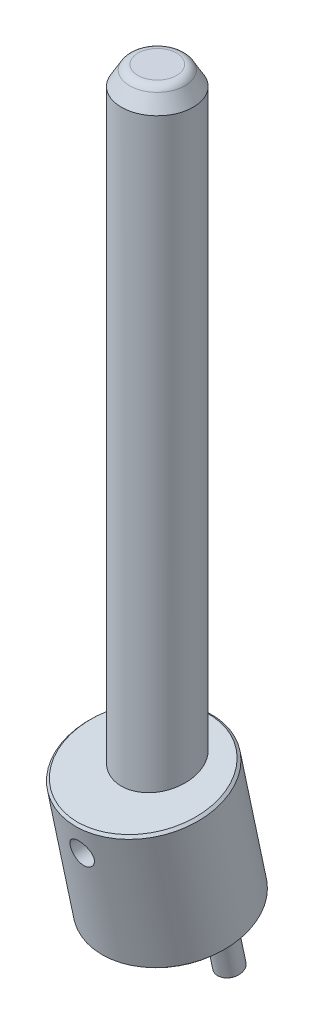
ISO-10303-21;
HEADER;
FILE_DESCRIPTION(('STEP AP214'),'2;1');
FILE_NAME('part.step','',(''),(''),'','','');
FILE_SCHEMA(('AUTOMOTIVE_DESIGN { 1 0 10303 214 1 1 1 1 }'));
ENDSEC;
DATA;
#1=APPLICATION_CONTEXT('core data for automotive mechanical design processes');
#2=APPLICATION_PROTOCOL_DEFINITION('international standard','automotive_design',2000,#1);
#3=PRODUCT_CONTEXT('',#1,'mechanical');
#4=PRODUCT('Part','Part','',(#3));
#5=PRODUCT_RELATED_PRODUCT_CATEGORY('part','',(#4));
#6=PRODUCT_DEFINITION_FORMATION('','',#4);
#7=PRODUCT_DEFINITION_CONTEXT('part definition',#1,'design');
#8=PRODUCT_DEFINITION('design','',#6,#7);
#9=PRODUCT_DEFINITION_SHAPE('','',#8);
#10=(LENGTH_UNIT() NAMED_UNIT(*) SI_UNIT(.MILLI.,.METRE.));
#11=(NAMED_UNIT(*) PLANE_ANGLE_UNIT() SI_UNIT($,.RADIAN.));
#12=(NAMED_UNIT(*) SI_UNIT($,.STERADIAN.) SOLID_ANGLE_UNIT());
#13=UNCERTAINTY_MEASURE_WITH_UNIT(LENGTH_MEASURE(1.E-05),#10,'distance_accuracy_value','');
#14=(GEOMETRIC_REPRESENTATION_CONTEXT(3) GLOBAL_UNCERTAINTY_ASSIGNED_CONTEXT((#13)) GLOBAL_UNIT_ASSIGNED_CONTEXT((#10,
#11,#12)) REPRESENTATION_CONTEXT('',''));
#15=CARTESIAN_POINT('',(0.,0.,0.));
#16=DIRECTION('',(0.,0.,1.));
#17=DIRECTION('',(1.,0.,0.));
#18=AXIS2_PLACEMENT_3D('',#15,#16,#17);
#19=CARTESIAN_POINT('',(0.,-24.717802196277,-8.68493275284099));
#20=DIRECTION('',(0.,-0.978147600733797,-0.207911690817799));
#21=DIRECTION('',(0.,0.207911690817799,-0.978147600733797));
#22=AXIS2_PLACEMENT_3D('',#19,#20,#21);
#23=PLANE('',#22);
#24=CARTESIAN_POINT('',(-21.5,-24.717802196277,-8.68493275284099));
#25=DIRECTION('',(0.,-0.978147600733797,-0.207911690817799));
#26=DIRECTION('',(0.,0.207911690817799,-0.978147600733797));
#27=AXIS2_PLACEMENT_3D('',#24,#25,#26);
#28=CIRCLE('',#27,4.50000075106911);
#29=CARTESIAN_POINT('',(-21.5,-23.7821994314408,-13.0865976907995));
#30=VERTEX_POINT('',#29);
#31=EDGE_CURVE('P0_E17',#30,#30,#28,.F.);
#32=ORIENTED_EDGE('',*,*,#31,.F.);
#33=EDGE_LOOP('',(#32));
#34=FACE_BOUND('',#33,.T.);
#35=ADVANCED_FACE('P0_F14',(#34),#23,.T.);
#36=CARTESIAN_POINT('',(0.,-24.717802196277,-8.68493275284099));
#37=DIRECTION('',(0.,-0.978147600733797,-0.207911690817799));
#38=DIRECTION('',(0.,0.207911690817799,-0.978147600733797));
#39=AXIS2_PLACEMENT_3D('',#36,#37,#38);
#40=PLANE('',#39);
#41=CARTESIAN_POINT('',(21.5,-24.717802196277,-8.68493275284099));
#42=DIRECTION('',(0.,-0.978147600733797,-0.207911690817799));
#43=DIRECTION('',(0.,0.207911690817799,-0.978147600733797));
#44=AXIS2_PLACEMENT_3D('',#41,#42,#43);
#45=CIRCLE('',#44,4.50000075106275);
#46=CARTESIAN_POINT('',(21.5,-23.7821994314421,-13.0865976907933));
#47=VERTEX_POINT('',#46);
#48=EDGE_CURVE('P0_E121',#47,#47,#45,.F.);
#49=ORIENTED_EDGE('',*,*,#48,.F.);
#50=EDGE_LOOP('',(#49));
#51=FACE_BOUND('',#50,.T.);
#52=ADVANCED_FACE('P0_F111',(#51),#40,.T.);
#53=CARTESIAN_POINT('',(0.,-3.09821612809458E-12,4.35415592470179E-13));
#54=DIRECTION('',(0.,-1.,0.));
#55=DIRECTION('',(0.,0.,-1.));
#56=AXIS2_PLACEMENT_3D('',#53,#54,#55);
#57=PLANE('',#56);
#58=CARTESIAN_POINT('',(0.,-3.69669572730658E-12,3.46077333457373E-12));
#59=DIRECTION('',(0.,-1.,0.));
#60=DIRECTION('',(0.,0.,-1.));
#61=AXIS2_PLACEMENT_3D('',#58,#59,#60);
#62=CIRCLE('',#61,15.);
#63=CARTESIAN_POINT('',(0.,-3.69669572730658E-12,-14.9999999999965));
#64=VERTEX_POINT('',#63);
#65=EDGE_CURVE('P0_E36',#64,#64,#62,.F.);
#66=ORIENTED_EDGE('',*,*,#65,.T.);
#67=EDGE_LOOP('',(#66));
#68=FACE_BOUND('',#67,.T.);
#69=ADVANCED_FACE('P0_F108',(#68),#57,.F.);
#70=CARTESIAN_POINT('',(-21.5,-24.2287278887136,-8.58097679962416));
#71=DIRECTION('',(0.,0.978147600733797,0.207911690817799));
#72=DIRECTION('',(0.,-0.207911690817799,0.978147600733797));
#73=AXIS2_PLACEMENT_3D('',#70,#71,#72);
#74=CONICAL_SURFACE('',#73,5.00000135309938,0.785398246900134);
#75=CARTESIAN_POINT('',(-21.5,-24.228726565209,-8.58097651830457));
#76=DIRECTION('',(0.,-0.978147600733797,-0.207911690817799));
#77=DIRECTION('',(0.,0.207911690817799,-0.978147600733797));
#78=AXIS2_PLACEMENT_3D('',#75,#76,#77);
#79=CIRCLE('',#78,5.);
#80=CARTESIAN_POINT('',(-21.5,-23.18916811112,-13.4717145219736));
#81=VERTEX_POINT('',#80);
#82=EDGE_CURVE('P0_E33',#81,#81,#79,.F.);
#83=ORIENTED_EDGE('',*,*,#82,.F.);
#84=EDGE_LOOP('',(#83));
#85=FACE_BOUND('',#84,.T.);
#86=ORIENTED_EDGE('',*,*,#31,.T.);
#87=EDGE_LOOP('',(#86));
#88=FACE_BOUND('',#87,.T.);
#89=ADVANCED_FACE('P0_F104',(#85,#88),#74,.T.);
#90=CARTESIAN_POINT('',(21.5,-24.2287278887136,-8.58097679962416));
#91=DIRECTION('',(0.,0.978147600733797,0.207911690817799));
#92=DIRECTION('',(0.,-0.207911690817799,0.978147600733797));
#93=AXIS2_PLACEMENT_3D('',#90,#91,#92);
#94=CONICAL_SURFACE('',#93,5.00000135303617,0.785398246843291);
#95=CARTESIAN_POINT('',(21.5,-24.228726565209,-8.58097651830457));
#96=DIRECTION('',(0.,-0.978147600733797,-0.207911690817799));
#97=DIRECTION('',(0.,0.207911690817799,-0.978147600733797));
#98=AXIS2_PLACEMENT_3D('',#95,#96,#97);
#99=CIRCLE('',#98,5.);
#100=CARTESIAN_POINT('',(21.5,-23.18916811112,-13.4717145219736));
#101=VERTEX_POINT('',#100);
#102=EDGE_CURVE('P0_E29',#101,#101,#99,.F.);
#103=ORIENTED_EDGE('',*,*,#102,.F.);
#104=EDGE_LOOP('',(#103));
#105=FACE_BOUND('',#104,.T.);
#106=ORIENTED_EDGE('',*,*,#48,.T.);
#107=EDGE_LOOP('',(#106));
#108=FACE_BOUND('',#107,.T.);
#109=ADVANCED_FACE('P0_F99',(#105,#108),#94,.T.);
#110=CARTESIAN_POINT('',(0.,61.1055773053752,3.46077333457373E-12));
#111=DIRECTION('',(0.,-1.,0.));
#112=DIRECTION('',(0.,0.,-1.));
#113=AXIS2_PLACEMENT_3D('',#110,#111,#112);
#114=CYLINDRICAL_SURFACE('',#113,15.);
#115=CARTESIAN_POINT('',(0.,44.9999999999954,3.45903861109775E-12));
#116=DIRECTION('',(0.,0.978147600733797,0.207911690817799));
#117=DIRECTION('',(0.,-0.207911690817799,0.978147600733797));
#118=AXIS2_PLACEMENT_3D('',#115,#116,#117);
#119=ELLIPSE('',#118,15.3351089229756,15.);
#120=CARTESIAN_POINT('',(0.,41.8116515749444,15.0000000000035));
#121=VERTEX_POINT('',#120);
#122=EDGE_CURVE('P0_E32',#121,#121,#119,.F.);
#123=ORIENTED_EDGE('',*,*,#122,.F.);
#124=EDGE_LOOP('',(#123));
#125=FACE_BOUND('',#124,.T.);
#126=ORIENTED_EDGE('',*,*,#65,.F.);
#127=EDGE_LOOP('',(#126));
#128=FACE_BOUND('',#127,.T.);
#129=CARTESIAN_POINT('',(0.,30.9999999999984,15.0000000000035));
#130=CARTESIAN_POINT('',(-0.13627460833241,30.9999999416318,14.9999999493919));
#131=CARTESIAN_POINT('',(-0.272550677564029,30.9944241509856,14.9981386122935));
#132=CARTESIAN_POINT('',(-0.544142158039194,30.9721706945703,14.9907428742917));
#133=CARTESIAN_POINT('',(-0.679457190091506,30.9554888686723,14.985207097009));
#134=CARTESIAN_POINT('',(-0.948257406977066,30.911149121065,14.970602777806));
#135=CARTESIAN_POINT('',(-1.08174007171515,30.8834773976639,14.9615297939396));
#136=CARTESIAN_POINT('',(-1.34580155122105,30.8174009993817,14.9400929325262));
#137=CARTESIAN_POINT('',(-1.47637921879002,30.7789921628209,14.9277277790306));
#138=CARTESIAN_POINT('',(-1.7333461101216,30.6918928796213,14.9000723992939));
#139=CARTESIAN_POINT('',(-1.85974572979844,30.6432305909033,14.8847901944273));
#140=CARTESIAN_POINT('',(-2.10792399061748,30.5359631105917,14.8516789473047));
#141=CARTESIAN_POINT('',(-2.22970089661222,30.4773542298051,14.833848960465));
#142=CARTESIAN_POINT('',(-2.58680471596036,30.2873070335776,14.7772227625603));
#143=CARTESIAN_POINT('',(-2.81420620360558,30.141545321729,14.7352562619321));
#144=CARTESIAN_POINT('',(-3.24874257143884,29.8108587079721,14.6457020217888));
#145=CARTESIAN_POINT('',(-3.45501840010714,29.6248491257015,14.5979792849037));
#146=CARTESIAN_POINT('',(-3.8341436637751,29.2211801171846,14.5030192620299));
#147=CARTESIAN_POINT('',(-4.0069839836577,29.003512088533,14.4557821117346));
#148=CARTESIAN_POINT('',(-4.31912807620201,28.5350726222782,14.3656662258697));
#149=CARTESIAN_POINT('',(-4.45732572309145,28.2835298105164,14.3229516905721));
#150=CARTESIAN_POINT('',(-4.68909399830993,27.7591186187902,14.2487652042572));
#151=CARTESIAN_POINT('',(-4.78267844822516,27.4862568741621,14.2172897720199));
#152=CARTESIAN_POINT('',(-4.91936749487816,26.9366338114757,14.1705651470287));
#153=CARTESIAN_POINT('',(-4.96406724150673,26.6603139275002,14.1548047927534));
#154=CARTESIAN_POINT('',(-5.00670561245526,26.1036813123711,14.1397828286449));
#155=CARTESIAN_POINT('',(-5.00465868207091,25.8233698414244,14.1405161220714));
#156=CARTESIAN_POINT('',(-4.95509941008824,25.2803173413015,14.1579507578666));
#157=CARTESIAN_POINT('',(-4.90966912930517,25.0173587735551,14.1739208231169));
#158=CARTESIAN_POINT('',(-4.77803186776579,24.5030345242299,14.218832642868));
#159=CARTESIAN_POINT('',(-4.69181981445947,24.2516702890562,14.2477760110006));
#160=CARTESIAN_POINT('',(-4.47968995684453,23.762927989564,14.3158968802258));
#161=CARTESIAN_POINT('',(-4.3531541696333,23.5258408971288,14.3552319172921));
#162=CARTESIAN_POINT('',(-4.06444611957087,23.0756402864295,14.4396288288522));
#163=CARTESIAN_POINT('',(-3.90226546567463,22.8625324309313,14.484692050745));
#164=CARTESIAN_POINT('',(-3.53674216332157,22.4545530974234,14.5783642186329));
#165=CARTESIAN_POINT('',(-3.33169626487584,22.2612084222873,14.6270356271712));
#166=CARTESIAN_POINT('',(-3.00176707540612,21.9988448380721,14.6970107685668));
#167=CARTESIAN_POINT('',(-2.88796886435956,21.915946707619,14.7198467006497));
#168=CARTESIAN_POINT('',(-2.65358317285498,21.7599196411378,14.7638979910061));
#169=CARTESIAN_POINT('',(-2.53299841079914,21.6867868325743,14.7851139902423));
#170=CARTESIAN_POINT('',(-2.2844294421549,21.5500863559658,14.8255663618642));
#171=CARTESIAN_POINT('',(-2.15637801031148,21.4866337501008,14.8447781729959));
#172=CARTESIAN_POINT('',(-1.89503347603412,21.3708247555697,14.8803974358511));
#173=CARTESIAN_POINT('',(-1.76174256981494,21.3184637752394,14.8968060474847));
#174=CARTESIAN_POINT('',(-1.49104566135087,21.2253547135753,14.9263287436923));
#175=CARTESIAN_POINT('',(-1.3536464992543,21.184588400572,14.9394479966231));
#176=CARTESIAN_POINT('',(-1.0756272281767,21.1149668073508,14.9620340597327));
#177=CARTESIAN_POINT('',(-0.93500858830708,21.0861062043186,14.9715025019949));
#178=CARTESIAN_POINT('',(-0.662330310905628,21.04228674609,14.9859443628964));
#179=CARTESIAN_POINT('',(-0.530427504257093,21.0264417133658,14.9912035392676));
#180=CARTESIAN_POINT('',(-0.265683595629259,21.0052983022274,14.9982313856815));
#181=CARTESIAN_POINT('',(-0.132842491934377,20.9999999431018,15.0000000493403));
#182=CARTESIAN_POINT('',(0.136274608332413,21.0000000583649,14.9999999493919));
#183=CARTESIAN_POINT('',(0.272550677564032,21.0055758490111,14.9981386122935));
#184=CARTESIAN_POINT('',(0.544142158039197,21.0278293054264,14.9907428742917));
#185=CARTESIAN_POINT('',(0.679457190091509,21.0445111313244,14.985207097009));
#186=CARTESIAN_POINT('',(0.948257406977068,21.0888508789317,14.970602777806));
#187=CARTESIAN_POINT('',(1.08174007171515,21.1165226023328,14.9615297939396));
#188=CARTESIAN_POINT('',(1.34580155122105,21.182599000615,14.9400929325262));
#189=CARTESIAN_POINT('',(1.47637921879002,21.2210078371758,14.9277277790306));
#190=CARTESIAN_POINT('',(1.7333461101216,21.3081071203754,14.9000723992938));
#191=CARTESIAN_POINT('',(1.85974572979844,21.3567694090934,14.8847901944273));
#192=CARTESIAN_POINT('',(2.10792399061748,21.464036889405,14.8516789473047));
#193=CARTESIAN_POINT('',(2.22970089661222,21.5226457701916,14.833848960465));
#194=CARTESIAN_POINT('',(2.58680471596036,21.7126929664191,14.7772227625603));
#195=CARTESIAN_POINT('',(2.81420620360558,21.8584546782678,14.7352562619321));
#196=CARTESIAN_POINT('',(3.24874257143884,22.1891412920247,14.6457020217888));
#197=CARTESIAN_POINT('',(3.45501840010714,22.3751508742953,14.5979792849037));
#198=CARTESIAN_POINT('',(3.8341436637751,22.7788198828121,14.5030192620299));
#199=CARTESIAN_POINT('',(4.0069839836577,22.9964879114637,14.4557821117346));
#200=CARTESIAN_POINT('',(4.31912807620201,23.4649273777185,14.3656662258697));
#201=CARTESIAN_POINT('',(4.45732572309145,23.7164701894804,14.3229516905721));
#202=CARTESIAN_POINT('',(4.68909399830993,24.2408813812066,14.2487652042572));
#203=CARTESIAN_POINT('',(4.78267844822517,24.5137431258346,14.2172897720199));
#204=CARTESIAN_POINT('',(4.91936749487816,25.063366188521,14.1705651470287));
#205=CARTESIAN_POINT('',(4.96406724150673,25.3396860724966,14.1548047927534));
#206=CARTESIAN_POINT('',(5.00670561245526,25.8963186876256,14.1397828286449));
#207=CARTESIAN_POINT('',(5.00465868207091,26.1766301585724,14.1405161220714));
#208=CARTESIAN_POINT('',(4.95509941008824,26.7196826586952,14.1579507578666));
#209=CARTESIAN_POINT('',(4.90966912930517,26.9826412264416,14.1739208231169));
#210=CARTESIAN_POINT('',(4.77803186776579,27.4969654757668,14.218832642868));
#211=CARTESIAN_POINT('',(4.69181981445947,27.7483297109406,14.2477760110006));
#212=CARTESIAN_POINT('',(4.47968995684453,28.2370720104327,14.3158968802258));
#213=CARTESIAN_POINT('',(4.35315416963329,28.4741591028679,14.3552319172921));
#214=CARTESIAN_POINT('',(4.06444611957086,28.9243597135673,14.4396288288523));
#215=CARTESIAN_POINT('',(3.90226546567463,29.1374675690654,14.484692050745));
#216=CARTESIAN_POINT('',(3.53674216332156,29.5454469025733,14.5783642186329));
#217=CARTESIAN_POINT('',(3.33169626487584,29.7387915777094,14.6270356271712));
#218=CARTESIAN_POINT('',(3.00176707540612,30.0011551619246,14.6970107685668));
#219=CARTESIAN_POINT('',(2.88796886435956,30.0840532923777,14.7198467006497));
#220=CARTESIAN_POINT('',(2.65358317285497,30.2400803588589,14.7638979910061));
#221=CARTESIAN_POINT('',(2.53299841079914,30.3132131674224,14.7851139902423));
#222=CARTESIAN_POINT('',(2.28442944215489,30.449913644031,14.8255663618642));
#223=CARTESIAN_POINT('',(2.15637801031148,30.5133662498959,14.8447781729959));
#224=CARTESIAN_POINT('',(1.89503347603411,30.6291752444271,14.8803974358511));
#225=CARTESIAN_POINT('',(1.76174256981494,30.6815362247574,14.8968060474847));
#226=CARTESIAN_POINT('',(1.49104566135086,30.7746452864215,14.9263287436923));
#227=CARTESIAN_POINT('',(1.3536464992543,30.8154115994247,14.9394479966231));
#228=CARTESIAN_POINT('',(1.0756272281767,30.8850331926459,14.9620340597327));
#229=CARTESIAN_POINT('',(0.935008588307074,30.9138937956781,14.9715025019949));
#230=CARTESIAN_POINT('',(0.662330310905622,30.9577132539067,14.9859443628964));
#231=CARTESIAN_POINT('',(0.530427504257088,30.973558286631,14.9912035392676));
#232=CARTESIAN_POINT('',(0.265683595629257,30.9947016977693,14.9982313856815));
#233=CARTESIAN_POINT('',(0.132842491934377,31.0000000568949,15.0000000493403));
#234=CARTESIAN_POINT('',(0.,30.9999999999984,15.0000000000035));
#235=B_SPLINE_CURVE_WITH_KNOTS('',3,(#129,#130,#131,#132,#133,#134,#135,#136,#137,#138,#139,
#140,#141,#142,#143,#144,#145,#146,#147,#148,#149,#150,#151,#152,#153,#154,#155,#156,#157,#158,
#159,#160,#161,#162,#163,#164,#165,#166,#167,#168,#169,#170,#171,#172,#173,#174,#175,#176,#177,
#178,#179,#180,#181,#182,#183,#184,#185,#186,#187,#188,#189,#190,#191,#192,#193,#194,#195,#196,
#197,#198,#199,#200,#201,#202,#203,#204,#205,#206,#207,#208,#209,#210,#211,#212,#213,#214,#215,
#216,#217,#218,#219,#220,#221,#222,#223,#224,#225,#226,#227,#228,#229,#230,#231,#232,#233,#234),
.UNSPECIFIED.,.T.,.F.,(4,2,2,2,2,2,2,2,2,2,2,2,2,2,2,2,2,2,2,2,2,2,2,2,2,2,2,2,2,2,2,2,2,2,2,2,
2,2,2,2,2,2,2,2,2,2,2,2,2,2,2,2,4),(0.,0.408700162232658,0.817553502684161,1.22692193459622,
1.6364492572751,2.04486626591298,2.45343508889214,3.26962321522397,4.11140352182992,
4.95341299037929,5.81961254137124,6.68554356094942,7.52228757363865,8.3587730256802,
9.15703078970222,9.95538786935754,10.7666215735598,11.5780464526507,12.4317109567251,
12.8591940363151,13.286507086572,13.7185586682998,14.150431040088,14.5816205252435,
15.0126170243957,15.4110232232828,15.8094301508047,16.2181303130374,16.6269836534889,
17.0363520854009,17.4458794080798,17.8542964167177,18.2628652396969,19.0790533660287,
19.9208336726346,20.762843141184,21.629042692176,22.4949737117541,23.3317177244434,
24.1682031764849,24.9664609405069,25.7648180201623,26.5760517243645,27.3874766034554,
28.2411411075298,28.6686241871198,29.0959372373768,29.5279888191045,29.9598611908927,
30.3910506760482,30.8220471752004,31.2204533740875,31.6188603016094),.UNSPECIFIED.);
#236=CARTESIAN_POINT('',(0.,30.9999999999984,15.0000000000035));
#237=VERTEX_POINT('',#236);
#238=EDGE_CURVE('P0_E84',#237,#237,#235,.T.);
#239=ORIENTED_EDGE('',*,*,#238,.T.);
#240=EDGE_LOOP('',(#239));
#241=FACE_BOUND('',#240,.T.);
#242=ADVANCED_FACE('P0_F93',(#125,#128,#241),#114,.F.);
#243=CARTESIAN_POINT('',(-21.5,-10.04558818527,-5.566257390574));
#244=DIRECTION('',(0.,-0.978147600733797,-0.207911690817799));
#245=DIRECTION('',(0.,0.207911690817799,-0.978147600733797));
#246=AXIS2_PLACEMENT_3D('',#243,#244,#245);
#247=CYLINDRICAL_SURFACE('',#246,5.);
#248=CARTESIAN_POINT('',(-21.5,-10.04558818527,-5.566257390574));
#249=DIRECTION('',(0.,-0.978147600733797,-0.207911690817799));
#250=DIRECTION('',(0.,0.207911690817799,-0.978147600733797));
#251=AXIS2_PLACEMENT_3D('',#248,#249,#250);
#252=CIRCLE('',#251,5.);
#253=CARTESIAN_POINT('',(-21.5,-9.006029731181,-10.456995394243));
#254=VERTEX_POINT('',#253);
#255=EDGE_CURVE('P0_E80',#254,#254,#252,.T.);
#256=ORIENTED_EDGE('',*,*,#255,.T.);
#257=EDGE_LOOP('',(#256));
#258=FACE_BOUND('',#257,.T.);
#259=ORIENTED_EDGE('',*,*,#82,.T.);
#260=EDGE_LOOP('',(#259));
#261=FACE_BOUND('',#260,.T.);
#262=ADVANCED_FACE('P0_F98',(#258,#261),#247,.T.);
#263=CARTESIAN_POINT('',(21.5,-10.04558818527,-5.566257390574));
#264=DIRECTION('',(0.,-0.978147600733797,-0.207911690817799));
#265=DIRECTION('',(0.,0.207911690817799,-0.978147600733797));
#266=AXIS2_PLACEMENT_3D('',#263,#264,#265);
#267=CYLINDRICAL_SURFACE('',#266,5.);
#268=CARTESIAN_POINT('',(21.5,-10.04558818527,-5.566257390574));
#269=DIRECTION('',(0.,-0.978147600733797,-0.207911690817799));
#270=DIRECTION('',(0.,0.207911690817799,-0.978147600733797));
#271=AXIS2_PLACEMENT_3D('',#268,#269,#270);
#272=CIRCLE('',#271,5.);
#273=CARTESIAN_POINT('',(21.5,-9.006029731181,-10.456995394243));
#274=VERTEX_POINT('',#273);
#275=EDGE_CURVE('P0_E76',#274,#274,#272,.T.);
#276=ORIENTED_EDGE('',*,*,#275,.T.);
#277=EDGE_LOOP('',(#276));
#278=FACE_BOUND('',#277,.T.);
#279=ORIENTED_EDGE('',*,*,#102,.T.);
#280=EDGE_LOOP('',(#279));
#281=FACE_BOUND('',#280,.T.);
#282=ADVANCED_FACE('P0_F178',(#278,#281),#267,.T.);
#283=CARTESIAN_POINT('',(0.,43.7525298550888,5.86888560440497));
#284=DIRECTION('',(0.,0.978147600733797,0.207911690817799));
#285=DIRECTION('',(0.,-0.207911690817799,0.978147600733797));
#286=AXIS2_PLACEMENT_3D('',#283,#284,#285);
#287=PLANE('',#286);
#288=ORIENTED_EDGE('',*,*,#122,.T.);
#289=EDGE_LOOP('',(#288));
#290=FACE_BOUND('',#289,.T.);
#291=CARTESIAN_POINT('',(0.,43.7525298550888,5.86888560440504));
#292=DIRECTION('',(0.,0.978147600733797,0.207911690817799));
#293=DIRECTION('',(0.,-0.207911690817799,0.978147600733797));
#294=AXIS2_PLACEMENT_3D('',#291,#292,#293);
#295=CIRCLE('',#294,27.9999945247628);
#296=CARTESIAN_POINT('',(0.,37.9310036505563,33.2570130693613));
#297=VERTEX_POINT('',#296);
#298=EDGE_CURVE('P0_E46',#297,#297,#295,.F.);
#299=ORIENTED_EDGE('',*,*,#298,.F.);
#300=EDGE_LOOP('',(#299));
#301=FACE_BOUND('',#300,.T.);
#302=ADVANCED_FACE('P0_F71',(#290,#301),#287,.T.);
#303=CARTESIAN_POINT('',(0.,25.9999999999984,-6.16394337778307));
#304=DIRECTION('',(0.,0.,1.));
#305=DIRECTION('',(0.,-1.,0.));
#306=AXIS2_PLACEMENT_3D('',#303,#304,#305);
#307=CYLINDRICAL_SURFACE('',#306,5.);
#308=ORIENTED_EDGE('',*,*,#238,.F.);
#309=EDGE_LOOP('',(#308));
#310=FACE_BOUND('',#309,.T.);
#311=CARTESIAN_POINT('',(0.,20.9999999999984,30.6805633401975));
#312=CARTESIAN_POINT('',(-0.140200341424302,21.0000005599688,30.6805631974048));
#313=CARTESIAN_POINT('',(-0.280415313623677,21.0059012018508,30.6807756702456));
#314=CARTESIAN_POINT('',(-0.559904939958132,21.0294682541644,30.6816452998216));
#315=CARTESIAN_POINT('',(-0.699179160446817,21.0471397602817,30.6823026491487));
#316=CARTESIAN_POINT('',(-0.975958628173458,21.094162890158,30.6841228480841));
#317=CARTESIAN_POINT('',(-1.11346086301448,21.1235322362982,30.6852864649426));
#318=CARTESIAN_POINT('',(-1.3855490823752,21.19375382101,30.688216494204));
#319=CARTESIAN_POINT('',(-1.52013395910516,21.2346103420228,30.6899831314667));
#320=CARTESIAN_POINT('',(-1.78523688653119,21.3274596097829,30.6942476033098));
#321=CARTESIAN_POINT('',(-1.91575902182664,21.3794407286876,30.6967446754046));
#322=CARTESIAN_POINT('',(-2.17199909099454,21.4942109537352,30.702631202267));
#323=CARTESIAN_POINT('',(-2.29771523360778,21.557004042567,30.7060209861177));
#324=CARTESIAN_POINT('',(-2.54329548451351,21.692875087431,30.7138720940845));
#325=CARTESIAN_POINT('',(-2.66316416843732,21.7659448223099,30.7183325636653));
#326=CARTESIAN_POINT('',(-2.89634220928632,21.9219020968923,30.7285265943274));
#327=CARTESIAN_POINT('',(-3.00964913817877,22.004793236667,30.734260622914));
#328=CARTESIAN_POINT('',(-3.22862523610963,22.1795856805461,30.7471941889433));
#329=CARTESIAN_POINT('',(-3.33430920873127,22.271468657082,30.754390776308));
#330=CARTESIAN_POINT('',(-3.53757337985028,22.463737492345,30.7704634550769));
#331=CARTESIAN_POINT('',(-3.63515057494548,22.5641264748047,30.779340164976));
#332=CARTESIAN_POINT('',(-3.82143427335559,22.7725903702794,30.7989616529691));
#333=CARTESIAN_POINT('',(-3.910143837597,22.880662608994,30.8097057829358));
#334=CARTESIAN_POINT('',(-4.07814208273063,23.1037502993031,30.8332419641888));
#335=CARTESIAN_POINT('',(-4.157427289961,23.2187682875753,30.846034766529));
#336=CARTESIAN_POINT('',(-4.30566674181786,23.4543151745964,30.8737481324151));
#337=CARTESIAN_POINT('',(-4.37466535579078,23.5748172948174,30.8886589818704));
#338=CARTESIAN_POINT('',(-4.502324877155,23.8209407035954,30.9207610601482));
#339=CARTESIAN_POINT('',(-4.56098199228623,23.9465638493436,30.9379531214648));
#340=CARTESIAN_POINT('',(-4.66754652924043,24.2019090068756,30.9746704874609));
#341=CARTESIAN_POINT('',(-4.71545821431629,24.3316293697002,30.9941948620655));
#342=CARTESIAN_POINT('',(-4.80031006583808,24.5942603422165,31.0355900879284));
#343=CARTESIAN_POINT('',(-4.83724614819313,24.7271721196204,31.0574618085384));
#344=CARTESIAN_POINT('',(-4.93151089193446,25.1302977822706,31.1267429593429));
#345=CARTESIAN_POINT('',(-4.97194793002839,25.4040635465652,31.1776994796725));
#346=CARTESIAN_POINT('',(-5.00734142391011,25.9526759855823,31.2879887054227));
#347=CARTESIAN_POINT('',(-5.00229216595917,26.227522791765,31.3473224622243));
#348=CARTESIAN_POINT('',(-4.94704037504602,26.777874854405,31.4741397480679));
#349=CARTESIAN_POINT('',(-4.89573928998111,27.0532325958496,31.5417867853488));
#350=CARTESIAN_POINT('',(-4.74844078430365,27.5905886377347,31.6813961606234));
#351=CARTESIAN_POINT('',(-4.65243324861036,27.8525838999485,31.7533594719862));
#352=CARTESIAN_POINT('',(-4.41450617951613,28.3653184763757,31.9008598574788));
#353=CARTESIAN_POINT('',(-4.27114117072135,28.6153755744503,31.9764354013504));
#354=CARTESIAN_POINT('',(-3.94304565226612,29.0878809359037,32.1248520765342));
#355=CARTESIAN_POINT('',(-3.75831250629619,29.3103274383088,32.197693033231));
#356=CARTESIAN_POINT('',(-3.45307474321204,29.6190485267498,32.3018628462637));
#357=CARTESIAN_POINT('',(-3.34614618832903,29.7181488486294,32.3358652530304));
#358=CARTESIAN_POINT('',(-3.12363545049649,29.9069364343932,32.4015272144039));
#359=CARTESIAN_POINT('',(-3.00805691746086,29.9966276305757,32.4331877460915));
#360=CARTESIAN_POINT('',(-2.76889141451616,30.1659006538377,32.4936435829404));
#361=CARTESIAN_POINT('',(-2.64529875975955,30.2454751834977,32.5224368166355));
#362=CARTESIAN_POINT('',(-2.39107139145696,30.3936784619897,32.5765921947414));
#363=CARTESIAN_POINT('',(-2.26044005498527,30.4623123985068,32.6019559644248));
#364=CARTESIAN_POINT('',(-1.99860893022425,30.5853690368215,32.6477960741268));
#365=CARTESIAN_POINT('',(-1.86765911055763,30.6402643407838,32.668431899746));
#366=CARTESIAN_POINT('',(-1.60111697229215,30.7388396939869,32.7057105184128));
#367=CARTESIAN_POINT('',(-1.46552689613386,30.7825250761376,32.7223552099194));
#368=CARTESIAN_POINT('',(-1.19097925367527,30.8581686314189,32.7513015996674));
#369=CARTESIAN_POINT('',(-1.05202953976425,30.8901517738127,32.7636125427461));
#370=CARTESIAN_POINT('',(-0.771649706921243,30.942151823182,32.783681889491));
#371=CARTESIAN_POINT('',(-0.630221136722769,30.9621759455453,32.7914430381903));
#372=CARTESIAN_POINT('',(-0.407075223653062,30.984067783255,32.7999375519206));
#373=CARTESIAN_POINT('',(-0.325797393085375,30.9900397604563,32.8022576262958));
#374=CARTESIAN_POINT('',(-0.163016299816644,30.9980061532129,32.8053534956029));
#375=CARTESIAN_POINT('',(-0.0815130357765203,31.0000005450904,32.8061292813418));
#376=CARTESIAN_POINT('',(0.134100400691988,30.9999991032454,32.8061284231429));
#377=CARTESIAN_POINT('',(0.268227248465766,30.9945989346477,32.8040273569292));
#378=CARTESIAN_POINT('',(0.535537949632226,30.9730468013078,32.7956594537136));
#379=CARTESIAN_POINT('',(0.668721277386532,30.9568892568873,32.7893904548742));
#380=CARTESIAN_POINT('',(0.933345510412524,30.9139456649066,32.7727879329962));
#381=CARTESIAN_POINT('',(1.06478300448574,30.8871412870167,32.7624474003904));
#382=CARTESIAN_POINT('',(1.3247874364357,30.8231601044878,32.7378875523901));
#383=CARTESIAN_POINT('',(1.45335321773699,30.7859791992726,32.7236667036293));
#384=CARTESIAN_POINT('',(1.70630285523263,30.7017272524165,32.6916477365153));
#385=CARTESIAN_POINT('',(1.83069834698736,30.6546869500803,32.6738607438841));
#386=CARTESIAN_POINT('',(2.07493605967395,30.5510731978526,32.6349859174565));
#387=CARTESIAN_POINT('',(2.19477657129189,30.4944962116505,32.6138968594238));
#388=CARTESIAN_POINT('',(2.54616653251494,30.3112253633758,32.5462055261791));
#389=CARTESIAN_POINT('',(2.76992292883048,30.1708778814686,32.4951350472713));
#390=CARTESIAN_POINT('',(3.19858546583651,29.8526500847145,32.3822194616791));
#391=CARTESIAN_POINT('',(3.40254569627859,29.6736184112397,32.3200573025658));
#392=CARTESIAN_POINT('',(3.778124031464,29.2861216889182,32.1897880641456));
#393=CARTESIAN_POINT('',(3.94973068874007,29.077646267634,32.1216788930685));
#394=CARTESIAN_POINT('',(4.2659298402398,28.623508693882,31.9789471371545));
#395=CARTESIAN_POINT('',(4.40836134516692,28.3763863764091,31.9041764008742));
#396=CARTESIAN_POINT('',(4.64936475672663,27.8612542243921,31.7557282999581));
#397=CARTESIAN_POINT('',(4.74792971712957,27.5932410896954,31.6820511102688));
#398=CARTESIAN_POINT('',(4.89979404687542,27.0376258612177,31.5377673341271));
#399=CARTESIAN_POINT('',(4.95213112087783,26.7497360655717,31.4672537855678));
#400=CARTESIAN_POINT('',(5.00573216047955,26.1673020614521,31.3339077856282));
#401=CARTESIAN_POINT('',(5.0070037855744,25.8727588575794,31.2710741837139));
#402=CARTESIAN_POINT('',(4.97024119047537,25.4365859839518,31.1849092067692));
#403=CARTESIAN_POINT('',(4.95197457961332,25.2937849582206,31.1578087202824));
#404=CARTESIAN_POINT('',(4.90309684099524,25.0098756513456,31.1060792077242));
#405=CARTESIAN_POINT('',(4.87249088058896,24.868766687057,31.081449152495));
#406=CARTESIAN_POINT('',(4.79904521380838,24.5893069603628,31.034746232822));
#407=CARTESIAN_POINT('',(4.75620242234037,24.4509569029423,31.0126740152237));
#408=CARTESIAN_POINT('',(4.65854471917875,24.1782069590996,30.9711232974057));
#409=CARTESIAN_POINT('',(4.60373477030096,24.043805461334,30.9516437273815));
#410=CARTESIAN_POINT('',(4.4844628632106,23.7843021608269,30.915825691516));
#411=CARTESIAN_POINT('',(4.42037391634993,23.6590400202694,30.8994055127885));
#412=CARTESIAN_POINT('',(4.28175593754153,23.4142028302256,30.8688694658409));
#413=CARTESIAN_POINT('',(4.2072311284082,23.2946255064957,30.8547526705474));
#414=CARTESIAN_POINT('',(4.04821203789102,23.0620015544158,30.8286845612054));
#415=CARTESIAN_POINT('',(3.9637153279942,22.9489565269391,30.8167337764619));
#416=CARTESIAN_POINT('',(3.78539550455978,22.7303408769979,30.7948424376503));
#417=CARTESIAN_POINT('',(3.69157591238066,22.6247674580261,30.7849011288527));
#418=CARTESIAN_POINT('',(3.49656424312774,22.4232080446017,30.7669540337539));
#419=CARTESIAN_POINT('',(3.3954868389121,22.3271131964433,30.7589242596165));
#420=CARTESIAN_POINT('',(3.18563362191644,22.1436867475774,30.7444372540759));
#421=CARTESIAN_POINT('',(3.07686072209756,22.056351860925,30.7379794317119));
#422=CARTESIAN_POINT('',(2.85226364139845,21.8909787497,30.7264248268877));
#423=CARTESIAN_POINT('',(2.73643397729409,21.8129478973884,30.7213291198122));
#424=CARTESIAN_POINT('',(2.49866451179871,21.666855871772,30.7123065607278));
#425=CARTESIAN_POINT('',(2.37672693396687,21.5987911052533,30.7083792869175));
#426=CARTESIAN_POINT('',(2.12717526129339,21.4728907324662,30.7014914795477));
#427=CARTESIAN_POINT('',(1.99954460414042,21.415087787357,30.6985340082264));
#428=CARTESIAN_POINT('',(1.73991752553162,21.3104082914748,30.6934320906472));
#429=CARTESIAN_POINT('',(1.60792273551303,21.2635277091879,30.6912873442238));
#430=CARTESIAN_POINT('',(1.34066028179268,21.181062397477,30.6876663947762));
#431=CARTESIAN_POINT('',(1.20539780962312,21.1454608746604,30.6861891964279));
#432=CARTESIAN_POINT('',(0.932412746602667,21.0857231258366,30.6837847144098));
#433=CARTESIAN_POINT('',(0.794691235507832,21.0615819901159,30.6828571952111));
#434=CARTESIAN_POINT('',(0.547472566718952,21.0288522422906,30.6816212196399));
#435=CARTESIAN_POINT('',(0.438265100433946,21.0180371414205,30.6812225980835));
#436=CARTESIAN_POINT('',(0.219374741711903,21.0036107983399,30.6806937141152));
#437=CARTESIAN_POINT('',(0.109691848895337,20.9999995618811,30.6805634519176));
#438=CARTESIAN_POINT('',(0.,20.9999999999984,30.6805633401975));
#439=B_SPLINE_CURVE_WITH_KNOTS('',3,(#311,#312,#313,#314,#315,#316,#317,#318,#319,#320,#321,
#322,#323,#324,#325,#326,#327,#328,#329,#330,#331,#332,#333,#334,#335,#336,#337,#338,#339,#340,
#341,#342,#343,#344,#345,#346,#347,#348,#349,#350,#351,#352,#353,#354,#355,#356,#357,#358,#359,
#360,#361,#362,#363,#364,#365,#366,#367,#368,#369,#370,#371,#372,#373,#374,#375,#376,#377,#378,
#379,#380,#381,#382,#383,#384,#385,#386,#387,#388,#389,#390,#391,#392,#393,#394,#395,#396,#397,
#398,#399,#400,#401,#402,#403,#404,#405,#406,#407,#408,#409,#410,#411,#412,#413,#414,#415,#416,
#417,#418,#419,#420,#421,#422,#423,#424,#425,#426,#427,#428,#429,#430,#431,#432,#433,#434,#435,
#436,#437,#438),.UNSPECIFIED.,.T.,.F.,(4,2,2,2,2,2,2,2,2,2,2,2,2,2,2,2,2,2,2,2,2,2,2,2,2,2,2,2,
2,2,2,2,2,2,2,2,2,2,2,2,2,2,2,2,2,2,2,2,2,2,2,2,2,2,2,2,2,2,2,2,2,2,2,4),(0.,0.420502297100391,
0.841186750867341,1.26251098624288,1.68399250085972,2.10503560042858,2.52623412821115,
2.94709760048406,3.368115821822,3.78829310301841,4.20862536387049,4.62881202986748,
5.04915309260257,5.46762509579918,5.88625023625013,6.30470899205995,6.72332326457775,
7.56326459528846,8.40331143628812,9.263852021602,10.1245874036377,11.0144884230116,
11.9044461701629,12.3530888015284,12.8015431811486,13.2503192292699,13.698881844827,
14.1287742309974,14.558461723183,14.9872269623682,15.4157332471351,15.6602229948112,
15.9047141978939,16.3069365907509,16.7093677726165,17.1124948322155,17.5157814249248,
17.917828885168,18.3200257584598,19.1233529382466,19.955076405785,20.7870936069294,
21.6676667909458,22.5483793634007,23.4470202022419,24.3455262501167,24.7845559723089,
25.2234020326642,25.6623588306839,26.1011339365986,26.5256014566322,26.9498977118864,
27.3742975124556,27.7985376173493,28.217134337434,28.6355734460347,29.0543419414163,
29.4729590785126,29.8928855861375,30.3126568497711,30.7318001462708,31.150763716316,
31.4797617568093,31.8087600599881),.UNSPECIFIED.);
#440=CARTESIAN_POINT('',(0.,20.9999999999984,30.6805633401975));
#441=VERTEX_POINT('',#440);
#442=EDGE_CURVE('P0_E39',#441,#441,#439,.T.);
#443=ORIENTED_EDGE('',*,*,#442,.F.);
#444=EDGE_LOOP('',(#443));
#445=FACE_BOUND('',#444,.T.);
#446=ADVANCED_FACE('P0_F48',(#310,#445),#307,.F.);
#447=CARTESIAN_POINT('',(0.,-10.04558818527,-5.566257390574));
#448=DIRECTION('',(0.,0.978147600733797,0.207911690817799));
#449=DIRECTION('',(0.,-0.207911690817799,0.978147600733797));
#450=AXIS2_PLACEMENT_3D('',#447,#448,#449);
#451=PLANE('',#450);
#452=ORIENTED_EDGE('',*,*,#275,.F.);
#453=EDGE_LOOP('',(#452));
#454=FACE_BOUND('',#453,.T.);
#455=ORIENTED_EDGE('',*,*,#255,.F.);
#456=EDGE_LOOP('',(#455));
#457=FACE_BOUND('',#456,.T.);
#458=CARTESIAN_POINT('',(-1.28369537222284E-13,-10.04558818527,-5.56625739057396));
#459=DIRECTION('',(0.,0.978147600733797,0.207911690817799));
#460=DIRECTION('',(0.,-0.207911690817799,0.978147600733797));
#461=AXIS2_PLACEMENT_3D('',#458,#459,#460);
#462=CIRCLE('',#461,27.9999942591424);
#463=CARTESIAN_POINT('',(-1.28369537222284E-13,-15.867114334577,21.8218698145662));
#464=VERTEX_POINT('',#463);
#465=EDGE_CURVE('P0_E26',#464,#464,#462,.T.);
#466=ORIENTED_EDGE('',*,*,#465,.F.);
#467=EDGE_LOOP('',(#466));
#468=FACE_BOUND('',#467,.T.);
#469=ADVANCED_FACE('P0_F63',(#454,#457,#468),#451,.F.);
#470=CARTESIAN_POINT('',(0.,42.7743793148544,5.66097328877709));
#471=DIRECTION('',(0.,-0.978147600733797,-0.207911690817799));
#472=DIRECTION('',(0.,0.207911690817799,-0.978147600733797));
#473=AXIS2_PLACEMENT_3D('',#470,#471,#472);
#474=CONICAL_SURFACE('',#473,28.9999973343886,0.785398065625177);
#475=ORIENTED_EDGE('',*,*,#298,.T.);
#476=EDGE_LOOP('',(#475));
#477=FACE_BOUND('',#476,.T.);
#478=CARTESIAN_POINT('',(0.,42.7743819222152,5.66097384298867));
#479=DIRECTION('',(0.,0.978147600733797,0.207911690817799));
#480=DIRECTION('',(0.,-0.207911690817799,0.978147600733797));
#481=AXIS2_PLACEMENT_3D('',#478,#479,#480);
#482=CIRCLE('',#481,29.);
#483=CARTESIAN_POINT('',(0.,36.7449428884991,34.0272542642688));
#484=VERTEX_POINT('',#483);
#485=EDGE_CURVE('P0_E21',#484,#484,#482,.F.);
#486=ORIENTED_EDGE('',*,*,#485,.F.);
#487=EDGE_LOOP('',(#486));
#488=FACE_BOUND('',#487,.T.);
#489=ADVANCED_FACE('P0_F60',(#477,#488),#474,.T.);
#490=CARTESIAN_POINT('',(-1.28369537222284E-13,-9.06743747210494,-5.35834503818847));
#491=DIRECTION('',(0.,0.978147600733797,0.207911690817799));
#492=DIRECTION('',(0.,-0.207911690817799,0.978147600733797));
#493=AXIS2_PLACEMENT_3D('',#490,#491,#492);
#494=CONICAL_SURFACE('',#493,28.9999972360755,0.785398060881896);
#495=CARTESIAN_POINT('',(0.,-9.0674401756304,-5.35834561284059));
#496=DIRECTION('',(0.,0.978147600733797,0.207911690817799));
#497=DIRECTION('',(0.,-0.207911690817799,0.978147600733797));
#498=AXIS2_PLACEMENT_3D('',#495,#496,#497);
#499=CIRCLE('',#498,29.);
#500=CARTESIAN_POINT('',(0.,-15.0968792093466,23.0079348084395));
#501=VERTEX_POINT('',#500);
#502=EDGE_CURVE('P0_E9',#501,#501,#499,.T.);
#503=ORIENTED_EDGE('',*,*,#502,.F.);
#504=EDGE_LOOP('',(#503));
#505=FACE_BOUND('',#504,.T.);
#506=ORIENTED_EDGE('',*,*,#465,.T.);
#507=EDGE_LOOP('',(#506));
#508=FACE_BOUND('',#507,.T.);
#509=ADVANCED_FACE('P0_F56',(#505,#508),#494,.T.);
#510=CARTESIAN_POINT('',(0.,-12.7354940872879,-6.13801454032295));
#511=DIRECTION('',(0.,0.978147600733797,0.207911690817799));
#512=DIRECTION('',(0.,-0.207911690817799,0.978147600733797));
#513=AXIS2_PLACEMENT_3D('',#510,#511,#512);
#514=CYLINDRICAL_SURFACE('',#513,29.);
#515=ORIENTED_EDGE('',*,*,#485,.T.);
#516=EDGE_LOOP('',(#515));
#517=FACE_BOUND('',#516,.T.);
#518=ORIENTED_EDGE('',*,*,#502,.T.);
#519=EDGE_LOOP('',(#518));
#520=FACE_BOUND('',#519,.T.);
#521=ORIENTED_EDGE('',*,*,#442,.T.);
#522=EDGE_LOOP('',(#521));
#523=FACE_BOUND('',#522,.T.);
#524=ADVANCED_FACE('P0_F52',(#517,#520,#523),#514,.T.);
#525=CLOSED_SHELL('',(#35,#52,#69,#89,#109,#242,#262,#282,#302,#446,#469,#489,#509,#524));
#526=MANIFOLD_SOLID_BREP('P0_B1',#525);
#527=CARTESIAN_POINT('',(0.,295.,0.));
#528=DIRECTION('',(0.,1.,0.));
#529=DIRECTION('',(-1.,0.,0.));
#530=AXIS2_PLACEMENT_3D('',#527,#528,#529);
#531=PLANE('',#530);
#532=CARTESIAN_POINT('',(0.,295.,0.));
#533=DIRECTION('',(0.,-1.,0.));
#534=DIRECTION('',(0.,0.,-1.));
#535=AXIS2_PLACEMENT_3D('',#532,#533,#534);
#536=CIRCLE('',#535,8.071796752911);
#537=CARTESIAN_POINT('',(0.,295.,-8.0717967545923));
#538=VERTEX_POINT('',#537);
#539=CARTESIAN_POINT('',(0.,295.,8.0717967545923));
#540=VERTEX_POINT('',#539);
#541=EDGE_CURVE('P1_E38',#538,#540,#536,.T.);
#542=ORIENTED_EDGE('',*,*,#541,.F.);
#543=CARTESIAN_POINT('',(0.,295.,0.));
#544=DIRECTION('',(0.,-1.,0.));
#545=DIRECTION('',(0.,0.,1.));
#546=AXIS2_PLACEMENT_3D('',#543,#544,#545);
#547=CIRCLE('',#546,8.071796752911);
#548=EDGE_CURVE('P1_E42',#540,#538,#547,.T.);
#549=ORIENTED_EDGE('',*,*,#548,.F.);
#550=EDGE_LOOP('',(#542,#549));
#551=FACE_BOUND('',#550,.T.);
#552=ADVANCED_FACE('P1_F17',(#551),#531,.T.);
#553=CARTESIAN_POINT('',(0.,291.,0.));
#554=DIRECTION('',(0.,1.,0.));
#555=DIRECTION('',(0.0058252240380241,0.,0.999983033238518));
#556=AXIS2_PLACEMENT_3D('',#553,#554,#555);
#557=TOROIDAL_SURFACE('',#556,8.071796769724,4.);
#558=ORIENTED_EDGE('',*,*,#541,.T.);
#559=ORIENTED_EDGE('',*,*,#548,.T.);
#560=EDGE_LOOP('',(#558,#559));
#561=FACE_BOUND('',#560,.T.);
#562=CARTESIAN_POINT('',(0.,293.000000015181,0.));
#563=DIRECTION('',(0.,-1.,0.));
#564=DIRECTION('',(0.,0.,1.));
#565=AXIS2_PLACEMENT_3D('',#562,#563,#564);
#566=CIRCLE('',#565,11.5358983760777);
#567=CARTESIAN_POINT('',(0.,293.000000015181,11.5358983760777));
#568=VERTEX_POINT('',#567);
#569=EDGE_CURVE('P1_E48',#568,#568,#566,.T.);
#570=ORIENTED_EDGE('',*,*,#569,.F.);
#571=EDGE_LOOP('',(#570));
#572=FACE_BOUND('',#571,.T.);
#573=ADVANCED_FACE('P1_F40',(#561,#572),#557,.T.);
#574=CARTESIAN_POINT('',(0.,0.,0.));
#575=DIRECTION('',(0.,1.,0.));
#576=DIRECTION('',(-1.,0.,0.));
#577=AXIS2_PLACEMENT_3D('',#574,#575,#576);
#578=PLANE('',#577);
#579=CARTESIAN_POINT('',(0.,0.,0.));
#580=DIRECTION('',(0.,1.,0.));
#581=DIRECTION('',(-1.,0.,0.));
#582=AXIS2_PLACEMENT_3D('',#579,#580,#581);
#583=CIRCLE('',#582,13.9999971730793);
#584=CARTESIAN_POINT('',(-13.9999971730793,0.,0.));
#585=VERTEX_POINT('',#584);
#586=EDGE_CURVE('P1_E85',#585,#585,#583,.T.);
#587=ORIENTED_EDGE('',*,*,#586,.F.);
#588=EDGE_LOOP('',(#587));
#589=FACE_BOUND('',#588,.T.);
#590=ADVANCED_FACE('P1_F76',(#589),#578,.F.);
#591=CARTESIAN_POINT('',(0.,26.,4.88675134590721));
#592=DIRECTION('',(0.,0.,1.));
#593=DIRECTION('',(0.,-1.,0.));
#594=AXIS2_PLACEMENT_3D('',#591,#592,#593);
#595=CONICAL_SURFACE('',#594,4.99999999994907,1.04719755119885);
#596=CARTESIAN_POINT('',(0.,26.0000000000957,1.99999999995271));
#597=VERTEX_POINT('',#596);
#598=VERTEX_LOOP('',#597);
#599=FACE_BOUND('',#598,.T.);
#600=CARTESIAN_POINT('',(0.,26.,4.886751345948));
#601=DIRECTION('',(0.,0.,1.));
#602=DIRECTION('',(0.,-1.,0.));
#603=AXIS2_PLACEMENT_3D('',#600,#601,#602);
#604=CIRCLE('',#603,5.);
#605=CARTESIAN_POINT('',(0.,21.,4.886751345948));
#606=VERTEX_POINT('',#605);
#607=EDGE_CURVE('P1_E82',#606,#606,#604,.T.);
#608=ORIENTED_EDGE('',*,*,#607,.T.);
#609=EDGE_LOOP('',(#608));
#610=FACE_BOUND('',#609,.T.);
#611=ADVANCED_FACE('P1_F116',(#599,#610),#595,.F.);
#612=CARTESIAN_POINT('',(0.,286.999999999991,0.));
#613=DIRECTION('',(0.,-1.,0.));
#614=DIRECTION('',(1.,0.,0.));
#615=AXIS2_PLACEMENT_3D('',#612,#613,#614);
#616=CONICAL_SURFACE('',#615,14.9999999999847,0.5235987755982);
#617=CARTESIAN_POINT('',(0.,287.,0.));
#618=DIRECTION('',(0.,1.,0.));
#619=DIRECTION('',(-1.,0.,0.));
#620=AXIS2_PLACEMENT_3D('',#617,#618,#619);
#621=CIRCLE('',#620,15.);
#622=CARTESIAN_POINT('',(-15.,287.,0.));
#623=VERTEX_POINT('',#622);
#624=EDGE_CURVE('P1_E92',#623,#623,#621,.F.);
#625=ORIENTED_EDGE('',*,*,#624,.F.);
#626=EDGE_LOOP('',(#625));
#627=FACE_BOUND('',#626,.T.);
#628=ORIENTED_EDGE('',*,*,#569,.T.);
#629=EDGE_LOOP('',(#628));
#630=FACE_BOUND('',#629,.T.);
#631=ADVANCED_FACE('P1_F108',(#627,#630),#616,.T.);
#632=CARTESIAN_POINT('',(0.,1.00000160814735,0.));
#633=DIRECTION('',(0.,1.,0.));
#634=DIRECTION('',(-1.,0.,0.));
#635=AXIS2_PLACEMENT_3D('',#632,#633,#634);
#636=CONICAL_SURFACE('',#635,14.9999985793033,0.785398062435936);
#637=CARTESIAN_POINT('',(0.,1.000000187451,0.));
#638=DIRECTION('',(0.,1.,0.));
#639=DIRECTION('',(-1.,0.,0.));
#640=AXIS2_PLACEMENT_3D('',#637,#638,#639);
#641=CIRCLE('',#640,15.);
#642=CARTESIAN_POINT('',(-15.,1.000000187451,0.));
#643=VERTEX_POINT('',#642);
#644=EDGE_CURVE('P1_E28',#643,#643,#641,.T.);
#645=ORIENTED_EDGE('',*,*,#644,.F.);
#646=EDGE_LOOP('',(#645));
#647=FACE_BOUND('',#646,.T.);
#648=ORIENTED_EDGE('',*,*,#586,.T.);
#649=EDGE_LOOP('',(#648));
#650=FACE_BOUND('',#649,.T.);
#651=ADVANCED_FACE('P1_F105',(#647,#650),#636,.T.);
#652=CARTESIAN_POINT('',(0.,26.,1.25));
#653=DIRECTION('',(0.,0.,1.));
#654=DIRECTION('',(0.,-1.,0.));
#655=AXIS2_PLACEMENT_3D('',#652,#653,#654);
#656=CYLINDRICAL_SURFACE('',#655,5.);
#657=ORIENTED_EDGE('',*,*,#607,.F.);
#658=EDGE_LOOP('',(#657));
#659=FACE_BOUND('',#658,.T.);
#660=CARTESIAN_POINT('',(0.,21.,15.));
#661=CARTESIAN_POINT('',(-0.136274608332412,21.0000000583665,14.9999999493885));
#662=CARTESIAN_POINT('',(-0.272550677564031,21.0055758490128,14.99813861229));
#663=CARTESIAN_POINT('',(-0.544142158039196,21.0278293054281,14.9907428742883));
#664=CARTESIAN_POINT('',(-0.679457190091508,21.044511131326,14.9852070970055));
#665=CARTESIAN_POINT('',(-0.948257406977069,21.0888508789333,14.9706027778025));
#666=CARTESIAN_POINT('',(-1.08174007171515,21.1165226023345,14.9615297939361));
#667=CARTESIAN_POINT('',(-1.34580155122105,21.1825990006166,14.9400929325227));
#668=CARTESIAN_POINT('',(-1.47637921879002,21.2210078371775,14.9277277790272));
#669=CARTESIAN_POINT('',(-1.7333461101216,21.308107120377,14.9000723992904));
#670=CARTESIAN_POINT('',(-1.85974572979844,21.356769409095,14.8847901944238));
#671=CARTESIAN_POINT('',(-2.10792399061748,21.4640368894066,14.8516789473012));
#672=CARTESIAN_POINT('',(-2.22970089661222,21.5226457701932,14.8338489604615));
#673=CARTESIAN_POINT('',(-2.58680471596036,21.7126929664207,14.7772227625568));
#674=CARTESIAN_POINT('',(-2.81420620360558,21.8584546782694,14.7352562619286));
#675=CARTESIAN_POINT('',(-3.24874257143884,22.1891412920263,14.6457020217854));
#676=CARTESIAN_POINT('',(-3.45501840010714,22.3751508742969,14.5979792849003));
#677=CARTESIAN_POINT('',(-3.8341436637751,22.7788198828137,14.5030192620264));
#678=CARTESIAN_POINT('',(-4.0069839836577,22.9964879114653,14.4557821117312));
#679=CARTESIAN_POINT('',(-4.31912807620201,23.4649273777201,14.3656662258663));
#680=CARTESIAN_POINT('',(-4.45732572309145,23.716470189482,14.3229516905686));
#681=CARTESIAN_POINT('',(-4.68909399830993,24.2408813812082,14.2487652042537));
#682=CARTESIAN_POINT('',(-4.78267844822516,24.5137431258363,14.2172897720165));
#683=CARTESIAN_POINT('',(-4.91936749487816,25.0633661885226,14.1705651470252));
#684=CARTESIAN_POINT('',(-4.96406724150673,25.3396860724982,14.15480479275));
#685=CARTESIAN_POINT('',(-5.00670561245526,25.8963186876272,14.1397828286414));
#686=CARTESIAN_POINT('',(-5.00465868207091,26.176630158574,14.1405161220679));
#687=CARTESIAN_POINT('',(-4.95509941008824,26.7196826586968,14.1579507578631));
#688=CARTESIAN_POINT('',(-4.90966912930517,26.9826412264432,14.1739208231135));
#689=CARTESIAN_POINT('',(-4.77803186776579,27.4969654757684,14.2188326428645));
#690=CARTESIAN_POINT('',(-4.69181981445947,27.7483297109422,14.2477760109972));
#691=CARTESIAN_POINT('',(-4.47968995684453,28.2370720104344,14.3158968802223));
#692=CARTESIAN_POINT('',(-4.3531541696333,28.4741591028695,14.3552319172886));
#693=CARTESIAN_POINT('',(-4.06444611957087,28.9243597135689,14.4396288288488));
#694=CARTESIAN_POINT('',(-3.90226546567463,29.1374675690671,14.4846920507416));
#695=CARTESIAN_POINT('',(-3.53674216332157,29.5454469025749,14.5783642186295));
#696=CARTESIAN_POINT('',(-3.33169626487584,29.7387915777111,14.6270356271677));
#697=CARTESIAN_POINT('',(-3.00176707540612,30.0011551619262,14.6970107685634));
#698=CARTESIAN_POINT('',(-2.88796886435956,30.0840532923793,14.7198467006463));
#699=CARTESIAN_POINT('',(-2.65358317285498,30.2400803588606,14.7638979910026));
#700=CARTESIAN_POINT('',(-2.53299841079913,30.3132131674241,14.7851139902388));
#701=CARTESIAN_POINT('',(-2.28442944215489,30.4499136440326,14.8255663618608));
#702=CARTESIAN_POINT('',(-2.15637801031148,30.5133662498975,14.8447781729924));
#703=CARTESIAN_POINT('',(-1.89503347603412,30.6291752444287,14.8803974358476));
#704=CARTESIAN_POINT('',(-1.76174256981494,30.681536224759,14.8968060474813));
#705=CARTESIAN_POINT('',(-1.49104566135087,30.7746452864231,14.9263287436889));
#706=CARTESIAN_POINT('',(-1.3536464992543,30.8154115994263,14.9394479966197));
#707=CARTESIAN_POINT('',(-1.0756272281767,30.8850331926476,14.9620340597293));
#708=CARTESIAN_POINT('',(-0.935008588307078,30.9138937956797,14.9715025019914));
#709=CARTESIAN_POINT('',(-0.662330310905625,30.9577132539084,14.9859443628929));
#710=CARTESIAN_POINT('',(-0.530427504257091,30.9735582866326,14.9912035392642));
#711=CARTESIAN_POINT('',(-0.265683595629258,30.994701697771,14.998231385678));
#712=CARTESIAN_POINT('',(-0.132842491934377,31.0000000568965,15.0000000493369));
#713=CARTESIAN_POINT('',(0.13627460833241,30.9999999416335,14.9999999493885));
#714=CARTESIAN_POINT('',(0.272550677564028,30.9944241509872,14.99813861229));
#715=CARTESIAN_POINT('',(0.544142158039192,30.9721706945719,14.9907428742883));
#716=CARTESIAN_POINT('',(0.679457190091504,30.955488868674,14.9852070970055));
#717=CARTESIAN_POINT('',(0.948257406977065,30.9111491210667,14.9706027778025));
#718=CARTESIAN_POINT('',(1.08174007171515,30.8834773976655,14.9615297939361));
#719=CARTESIAN_POINT('',(1.34580155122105,30.8174009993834,14.9400929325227));
#720=CARTESIAN_POINT('',(1.47637921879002,30.7789921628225,14.9277277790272));
#721=CARTESIAN_POINT('',(1.7333461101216,30.691892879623,14.9000723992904));
#722=CARTESIAN_POINT('',(1.85974572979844,30.643230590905,14.8847901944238));
#723=CARTESIAN_POINT('',(2.10792399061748,30.5359631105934,14.8516789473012));
#724=CARTESIAN_POINT('',(2.22970089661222,30.4773542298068,14.8338489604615));
#725=CARTESIAN_POINT('',(2.58680471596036,30.2873070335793,14.7772227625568));
#726=CARTESIAN_POINT('',(2.81420620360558,30.1415453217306,14.7352562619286));
#727=CARTESIAN_POINT('',(3.24874257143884,29.8108587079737,14.6457020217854));
#728=CARTESIAN_POINT('',(3.45501840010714,29.6248491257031,14.5979792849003));
#729=CARTESIAN_POINT('',(3.8341436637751,29.2211801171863,14.5030192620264));
#730=CARTESIAN_POINT('',(4.0069839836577,29.0035120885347,14.4557821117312));
#731=CARTESIAN_POINT('',(4.31912807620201,28.5350726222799,14.3656662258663));
#732=CARTESIAN_POINT('',(4.45732572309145,28.283529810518,14.3229516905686));
#733=CARTESIAN_POINT('',(4.68909399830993,27.7591186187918,14.2487652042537));
#734=CARTESIAN_POINT('',(4.78267844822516,27.4862568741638,14.2172897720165));
#735=CARTESIAN_POINT('',(4.91936749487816,26.9366338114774,14.1705651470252));
#736=CARTESIAN_POINT('',(4.96406724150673,26.6603139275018,14.15480479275));
#737=CARTESIAN_POINT('',(5.00670561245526,26.1036813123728,14.1397828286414));
#738=CARTESIAN_POINT('',(5.00465868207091,25.823369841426,14.1405161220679));
#739=CARTESIAN_POINT('',(4.95509941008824,25.2803173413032,14.1579507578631));
#740=CARTESIAN_POINT('',(4.90966912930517,25.0173587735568,14.1739208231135));
#741=CARTESIAN_POINT('',(4.77803186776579,24.5030345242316,14.2188326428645));
#742=CARTESIAN_POINT('',(4.69181981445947,24.2516702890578,14.2477760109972));
#743=CARTESIAN_POINT('',(4.47968995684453,23.7629279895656,14.3158968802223));
#744=CARTESIAN_POINT('',(4.35315416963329,23.5258408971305,14.3552319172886));
#745=CARTESIAN_POINT('',(4.06444611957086,23.0756402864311,14.4396288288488));
#746=CARTESIAN_POINT('',(3.90226546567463,22.8625324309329,14.4846920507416));
#747=CARTESIAN_POINT('',(3.53674216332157,22.4545530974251,14.5783642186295));
#748=CARTESIAN_POINT('',(3.33169626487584,22.2612084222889,14.6270356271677));
#749=CARTESIAN_POINT('',(3.00176707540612,21.9988448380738,14.6970107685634));
#750=CARTESIAN_POINT('',(2.88796886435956,21.9159467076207,14.7198467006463));
#751=CARTESIAN_POINT('',(2.65358317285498,21.7599196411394,14.7638979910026));
#752=CARTESIAN_POINT('',(2.53299841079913,21.6867868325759,14.7851139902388));
#753=CARTESIAN_POINT('',(2.28442944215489,21.5500863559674,14.8255663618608));
#754=CARTESIAN_POINT('',(2.15637801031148,21.4866337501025,14.8447781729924));
#755=CARTESIAN_POINT('',(1.89503347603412,21.3708247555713,14.8803974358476));
#756=CARTESIAN_POINT('',(1.76174256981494,21.318463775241,14.8968060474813));
#757=CARTESIAN_POINT('',(1.49104566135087,21.2253547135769,14.9263287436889));
#758=CARTESIAN_POINT('',(1.3536464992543,21.1845884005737,14.9394479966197));
#759=CARTESIAN_POINT('',(1.07562722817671,21.1149668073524,14.9620340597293));
#760=CARTESIAN_POINT('',(0.935008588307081,21.0861062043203,14.9715025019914));
#761=CARTESIAN_POINT('',(0.662330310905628,21.0422867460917,14.9859443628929));
#762=CARTESIAN_POINT('',(0.530427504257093,21.0264417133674,14.9912035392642));
#763=CARTESIAN_POINT('',(0.265683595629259,21.005298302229,14.998231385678));
#764=CARTESIAN_POINT('',(0.132842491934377,20.9999999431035,15.0000000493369));
#765=CARTESIAN_POINT('',(0.,21.,15.));
#766=B_SPLINE_CURVE_WITH_KNOTS('',3,(#660,#661,#662,#663,#664,#665,#666,#667,#668,#669,#670,
#671,#672,#673,#674,#675,#676,#677,#678,#679,#680,#681,#682,#683,#684,#685,#686,#687,#688,#689,
#690,#691,#692,#693,#694,#695,#696,#697,#698,#699,#700,#701,#702,#703,#704,#705,#706,#707,#708,
#709,#710,#711,#712,#713,#714,#715,#716,#717,#718,#719,#720,#721,#722,#723,#724,#725,#726,#727,
#728,#729,#730,#731,#732,#733,#734,#735,#736,#737,#738,#739,#740,#741,#742,#743,#744,#745,#746,
#747,#748,#749,#750,#751,#752,#753,#754,#755,#756,#757,#758,#759,#760,#761,#762,#763,#764,#765),
.UNSPECIFIED.,.T.,.F.,(4,2,2,2,2,2,2,2,2,2,2,2,2,2,2,2,2,2,2,2,2,2,2,2,2,2,2,2,2,2,2,2,2,2,2,2,
2,2,2,2,2,2,2,2,2,2,2,2,2,2,2,2,4),(0.,0.408700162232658,0.817553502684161,1.22692193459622,
1.6364492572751,2.04486626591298,2.45343508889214,3.26962321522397,4.11140352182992,
4.9534129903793,5.81961254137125,6.68554356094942,7.52228757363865,8.3587730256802,
9.15703078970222,9.95538786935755,10.7666215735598,11.5780464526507,12.4317109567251,
12.8591940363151,13.286507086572,13.7185586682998,14.150431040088,14.5816205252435,
15.0126170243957,15.4110232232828,15.8094301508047,16.2181303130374,16.6269836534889,
17.0363520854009,17.4458794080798,17.8542964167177,18.2628652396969,19.0790533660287,
19.9208336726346,20.762843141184,21.629042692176,22.4949737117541,23.3317177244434,
24.1682031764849,24.9664609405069,25.7648180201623,26.5760517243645,27.3874766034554,
28.2411411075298,28.6686241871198,29.0959372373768,29.5279888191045,29.9598611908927,
30.3910506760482,30.8220471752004,31.2204533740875,31.6188603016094),.UNSPECIFIED.);
#767=CARTESIAN_POINT('',(0.,21.,15.));
#768=VERTEX_POINT('',#767);
#769=EDGE_CURVE('P1_E11',#768,#768,#766,.T.);
#770=ORIENTED_EDGE('',*,*,#769,.F.);
#771=EDGE_LOOP('',(#770));
#772=FACE_BOUND('',#771,.T.);
#773=ADVANCED_FACE('P1_F107',(#659,#772),#656,.F.);
#774=CARTESIAN_POINT('',(0.,-14.75,0.));
#775=DIRECTION('',(0.,1.,0.));
#776=DIRECTION('',(-1.,0.,0.));
#777=AXIS2_PLACEMENT_3D('',#774,#775,#776);
#778=CYLINDRICAL_SURFACE('',#777,15.);
#779=ORIENTED_EDGE('',*,*,#624,.T.);
#780=EDGE_LOOP('',(#779));
#781=FACE_BOUND('',#780,.T.);
#782=ORIENTED_EDGE('',*,*,#644,.T.);
#783=EDGE_LOOP('',(#782));
#784=FACE_BOUND('',#783,.T.);
#785=ORIENTED_EDGE('',*,*,#769,.T.);
#786=EDGE_LOOP('',(#785));
#787=FACE_BOUND('',#786,.T.);
#788=ADVANCED_FACE('P1_F102',(#781,#784,#787),#778,.T.);
#789=CLOSED_SHELL('',(#552,#573,#590,#611,#631,#651,#773,#788));
#790=MANIFOLD_SOLID_BREP('P1_B1',#789);
#791=ADVANCED_BREP_SHAPE_REPRESENTATION('',(#18,#526,#790),#14);
#792=SHAPE_DEFINITION_REPRESENTATION(#9,#791);
ENDSEC;
END-ISO-10303-21;
